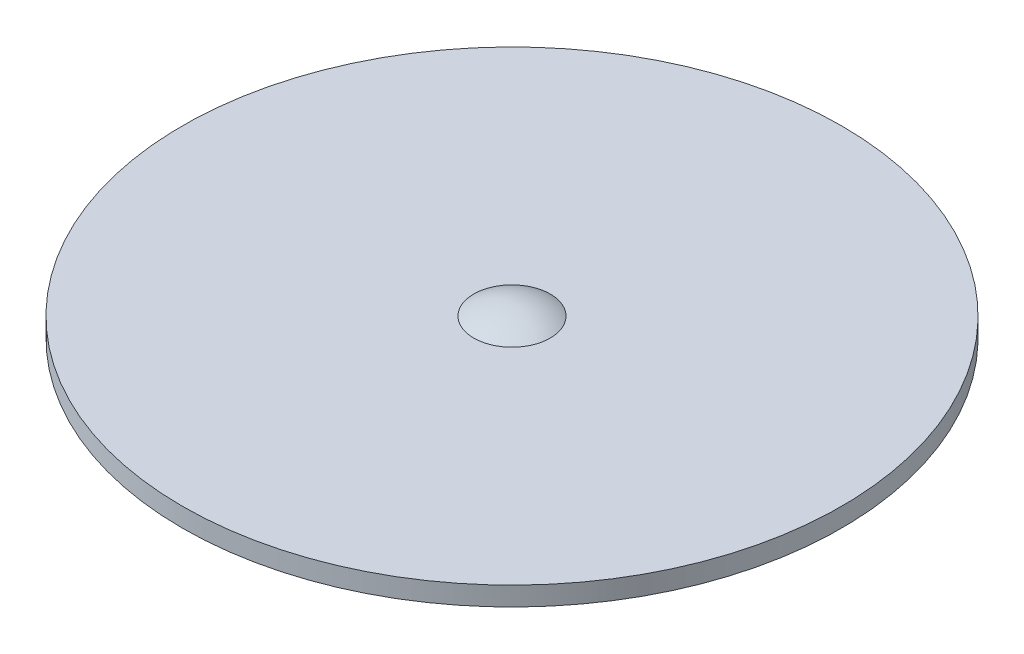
from build123d import *


with BuildPart() as part:
    # Sketch2 → Revolve2 (revolve)
    with BuildSketch(Plane.XY):
        with BuildLine():
            Line((-15.875, 0), (-1.8415, 0))
            ThreePointArc((-1.8415, 0), (-0.955142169, 0.378671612), (0, 0.508))
            Line((0, 0.508), (0, -0.4064))
            ThreePointArc((0, -0.4064), (-0.824644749, -0.536564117), (-1.56910543, -0.9144))
            Line((-1.56910543, -0.9144), (-15.875, -0.9144))
            Line((-15.875, -0.9144), (-15.875, 0))
        make_face()
    revolve(axis=Axis((0, 0, 0), (0, -1, 0)))


solid = part.part
